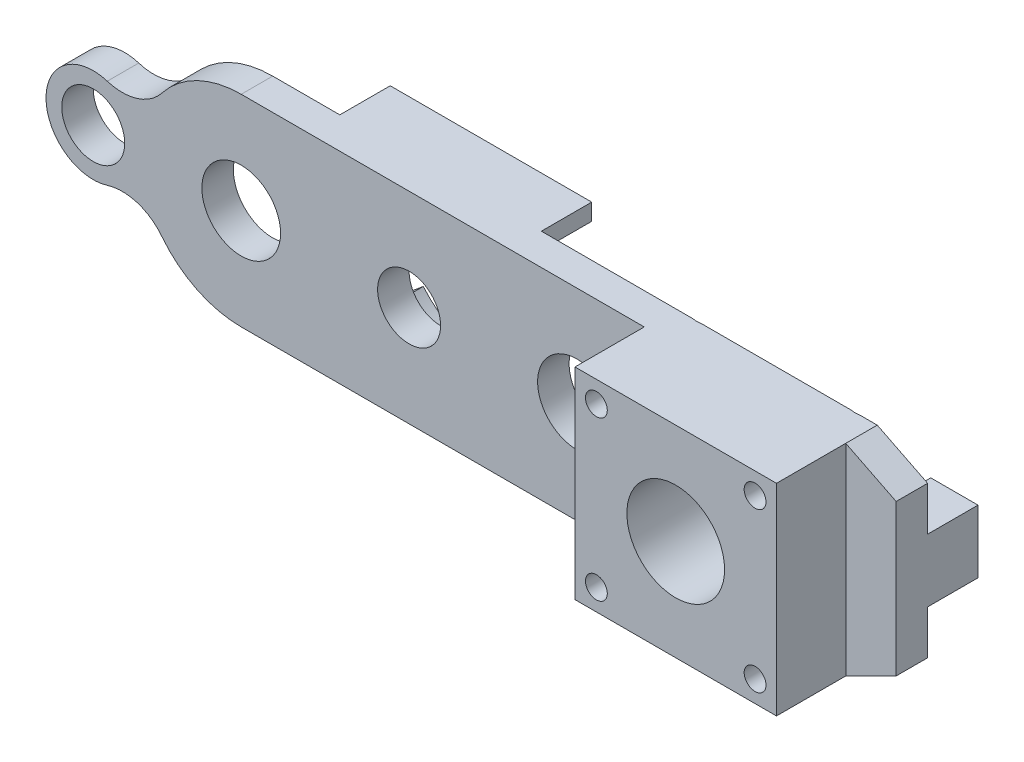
from build123d import *

# Parameters (mm, degrees)
SKETCH1_R                                       = 3.96875
SKETCH1_R_2                                     = 3.175
SKETCH1_R_3                                     = 4.925899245
BOSS_EXTRUDE1_DEPTH                             = 3.175
SKETCH13_W                                      = 20.32
SKETCH13_H                                      = 20.32
SKETCH13_R                                      = 4.925899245
BOSS_EXTRUDE5_DEPTH                             = 6.985
CSK_FOR_M2_FLAT_HEAD_MACHINE_SCREW1_D           = 2.2
CSK_FOR_M2_FLAT_HEAD_MACHINE_SCREW1_CSINK_D     = 4.4
CSK_FOR_M2_FLAT_HEAD_MACHINE_SCREW1_CSINK_ANGLE = 90
SKETCH11_W                                      = 4.7625
SKETCH11_H                                      = 6.35
BOSS_EXTRUDE4_DEPTH                             = 5.08


with BuildPart() as part:
    # Sketch1 → Boss-Extrude1 (new body)
    with BuildSketch(Plane.XY):
        with BuildLine():
            Line((-66.04, 0), (-5.08, 0))
            Line((-5.08, 0), (0, 2.54))
            Line((0, 2.54), (0, 17.78))
            Line((0, 17.78), (-5.08, 20.32))
            Line((-5.08, 20.32), (-66.04, 20.32))
            ThreePointArc((-66.04, 20.32), (-70.488094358, 19.294552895), (-74.038297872, 16.425207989))
            ThreePointArc((-74.038297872, 16.425207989), (-76.525127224, 14.708142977), (-79.547151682, 14.707328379))
            ThreePointArc((-79.547151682, 14.707328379), (-85.725, 10.16), (-79.547151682, 5.612671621))
            ThreePointArc((-79.547151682, 5.612671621), (-76.525127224, 5.611857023), (-74.038297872, 3.894792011))
            ThreePointArc((-74.038297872, 3.894792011), (-70.488094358, 1.025447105), (-66.04, 0))
        make_face()
        with Locations((-66.04, 10.16)):
            Circle(SKETCH1_R, mode=Mode.SUBTRACT)
        with Locations((-80.9625, 10.16)):
            Circle(SKETCH1_R_2, mode=Mode.SUBTRACT)
        with Locations((-15.24, 10.16)):
            Circle(SKETCH1_R_3, mode=Mode.SUBTRACT)
        with Locations((-32.1818, 10.16)):
            Circle(SKETCH1_R, mode=Mode.SUBTRACT)
        with Locations((-49.1109, 10.16)):
            Circle(SKETCH1_R_2, mode=Mode.SUBTRACT)
    extrude(amount=BOSS_EXTRUDE1_DEPTH)

    # Sketch13 → Boss-Extrude5 (add)
    with BuildSketch(Plane.XY.offset(3.175)):
        with Locations((-15.24, 10.16)):
            Rectangle(SKETCH13_W, SKETCH13_H)
        with Locations((-15.24, 10.16)):
            Circle(SKETCH13_R, mode=Mode.SUBTRACT)
    extrude(amount=BOSS_EXTRUDE5_DEPTH)

    # CSK for M2 Flat Head Machine Screw1 (through all)
    with Locations(Plane(origin=(0, 0, 0), x_dir=(-1, 0, 0), z_dir=(0, 0, -1))):
        with Locations((7.239, 18.161), (23.241, 18.161), (23.241, 2.159), (7.239, 2.159)):
            CounterSinkHole(CSK_FOR_M2_FLAT_HEAD_MACHINE_SCREW1_D / 2, CSK_FOR_M2_FLAT_HEAD_MACHINE_SCREW1_CSINK_D / 2, counter_sink_angle=CSK_FOR_M2_FLAT_HEAD_MACHINE_SCREW1_CSINK_ANGLE)

    # Sketch11 → Boss-Extrude4 (add)
    with BuildSketch(Plane(origin=(0, 0, 0), x_dir=(-1, 0, 0), z_dir=(0, 0, -1))):
        with BuildLine():
            Line((59.2709, 20.32), (38.9509, 20.32))
            Line((38.9509, 20.32), (38.9509, 18.641188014))
            Line((38.9509, 18.641188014), (42.286212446, 15.856993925))
            ThreePointArc((42.286212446, 15.856993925), (49.1109, 19.05), (55.935587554, 15.856993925))
            Line((55.935587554, 15.856993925), (59.2709, 18.641188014))
            Line((59.2709, 18.641188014), (59.2709, 20.32))
        make_face()
        with BuildLine():
            Line((59.2709, 0), (59.2709, 1.678811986))
            Line((59.2709, 1.678811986), (55.935587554, 4.463006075))
            ThreePointArc((55.935587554, 4.463006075), (49.1109, 1.27), (42.286212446, 4.463006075))
            Line((42.286212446, 4.463006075), (38.9509, 1.678811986))
            Line((38.9509, 1.678811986), (38.9509, 0))
            Line((38.9509, 0), (59.2709, 0))
        make_face()
        with Locations((2.38125, 10.16)):
            Rectangle(SKETCH11_W, SKETCH11_H)
    extrude(amount=BOSS_EXTRUDE4_DEPTH)


solid = part.part
